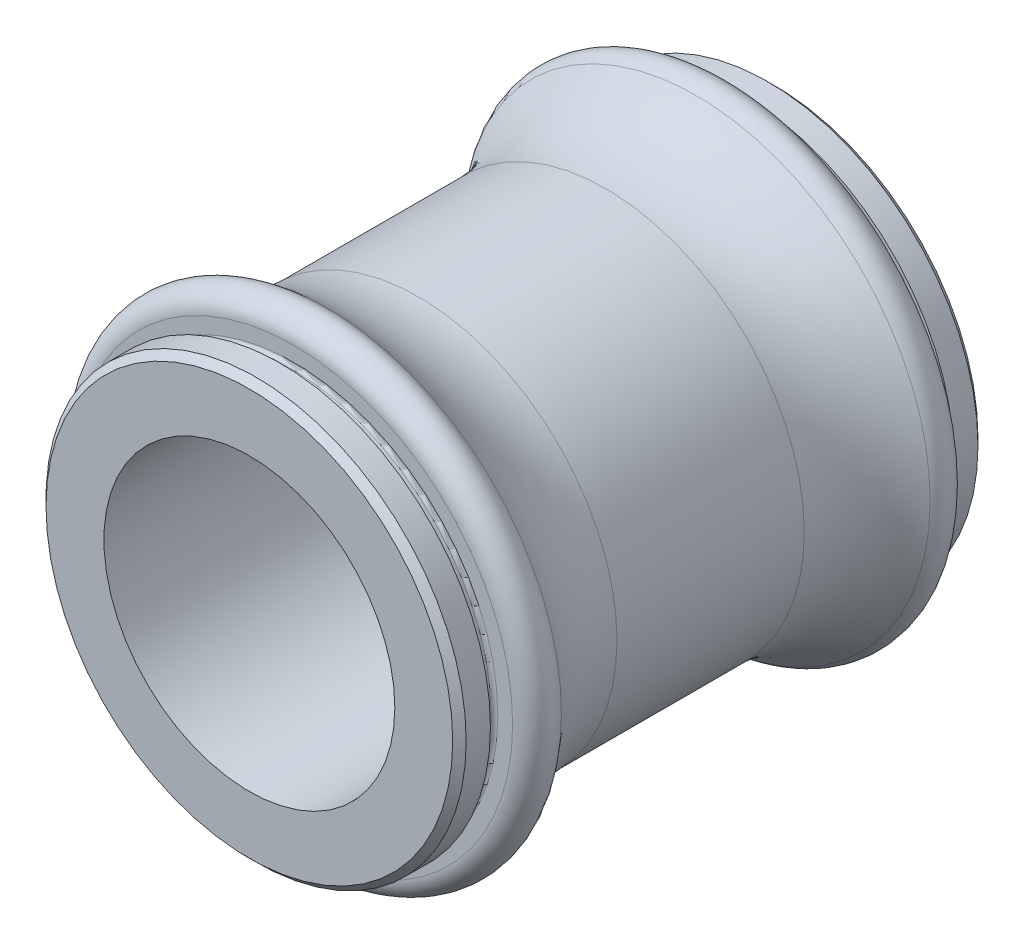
ISO-10303-21;
HEADER;
FILE_DESCRIPTION(('STEP AP214'),'2;1');
FILE_NAME('part.step','',(''),(''),'','','');
FILE_SCHEMA(('AUTOMOTIVE_DESIGN { 1 0 10303 214 1 1 1 1 }'));
ENDSEC;
DATA;
#1=APPLICATION_CONTEXT('core data for automotive mechanical design processes');
#2=APPLICATION_PROTOCOL_DEFINITION('international standard','automotive_design',2000,#1);
#3=PRODUCT_CONTEXT('',#1,'mechanical');
#4=PRODUCT('Part','Part','',(#3));
#5=PRODUCT_RELATED_PRODUCT_CATEGORY('part','',(#4));
#6=PRODUCT_DEFINITION_FORMATION('','',#4);
#7=PRODUCT_DEFINITION_CONTEXT('part definition',#1,'design');
#8=PRODUCT_DEFINITION('design','',#6,#7);
#9=PRODUCT_DEFINITION_SHAPE('','',#8);
#10=(LENGTH_UNIT() NAMED_UNIT(*) SI_UNIT(.MILLI.,.METRE.));
#11=(NAMED_UNIT(*) PLANE_ANGLE_UNIT() SI_UNIT($,.RADIAN.));
#12=(NAMED_UNIT(*) SI_UNIT($,.STERADIAN.) SOLID_ANGLE_UNIT());
#13=UNCERTAINTY_MEASURE_WITH_UNIT(LENGTH_MEASURE(1.E-05),#10,'distance_accuracy_value','');
#14=(GEOMETRIC_REPRESENTATION_CONTEXT(3) GLOBAL_UNCERTAINTY_ASSIGNED_CONTEXT((#13)) GLOBAL_UNIT_ASSIGNED_CONTEXT((#10,
#11,#12)) REPRESENTATION_CONTEXT('',''));
#15=CARTESIAN_POINT('',(0.,0.,0.));
#16=DIRECTION('',(0.,0.,1.));
#17=DIRECTION('',(1.,0.,0.));
#18=AXIS2_PLACEMENT_3D('',#15,#16,#17);
#19=CARTESIAN_POINT('',(0.,15.1,39.));
#20=DIRECTION('',(0.,0.,-1.));
#21=DIRECTION('',(-1.,0.,0.));
#22=AXIS2_PLACEMENT_3D('',#19,#20,#21);
#23=PLANE('',#22);
#24=CARTESIAN_POINT('',(0.,0.,39.));
#25=DIRECTION('',(0.,0.,1.));
#26=DIRECTION('',(1.,0.,0.));
#27=AXIS2_PLACEMENT_3D('',#24,#25,#26);
#28=CIRCLE('',#27,10.8);
#29=CARTESIAN_POINT('',(10.8,0.,39.));
#30=VERTEX_POINT('',#29);
#31=EDGE_CURVE('E103',#30,#30,#28,.T.);
#32=ORIENTED_EDGE('',*,*,#31,.F.);
#33=EDGE_LOOP('',(#32));
#34=FACE_BOUND('',#33,.T.);
#35=CARTESIAN_POINT('',(0.,0.,39.));
#36=DIRECTION('',(0.,0.,1.));
#37=DIRECTION('',(1.,0.,0.));
#38=AXIS2_PLACEMENT_3D('',#35,#36,#37);
#39=CIRCLE('',#38,15.1);
#40=CARTESIAN_POINT('',(15.1,0.,39.));
#41=VERTEX_POINT('',#40);
#42=EDGE_CURVE('E10',#41,#41,#39,.T.);
#43=ORIENTED_EDGE('',*,*,#42,.T.);
#44=EDGE_LOOP('',(#43));
#45=FACE_BOUND('',#44,.T.);
#46=ADVANCED_FACE('F33',(#34,#45),#23,.F.);
#47=CARTESIAN_POINT('',(0.,0.,38.5));
#48=DIRECTION('',(0.,0.,-1.));
#49=DIRECTION('',(-1.,0.,0.));
#50=AXIS2_PLACEMENT_3D('',#47,#48,#49);
#51=CONICAL_SURFACE('',#50,15.6,0.785398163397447);
#52=ORIENTED_EDGE('',*,*,#42,.F.);
#53=EDGE_LOOP('',(#52));
#54=FACE_BOUND('',#53,.T.);
#55=CARTESIAN_POINT('',(0.,0.,38.5));
#56=DIRECTION('',(0.,0.,1.));
#57=DIRECTION('',(1.,0.,0.));
#58=AXIS2_PLACEMENT_3D('',#55,#56,#57);
#59=CIRCLE('',#58,15.6);
#60=CARTESIAN_POINT('',(15.6,0.,38.5));
#61=VERTEX_POINT('',#60);
#62=EDGE_CURVE('E39',#61,#61,#59,.T.);
#63=ORIENTED_EDGE('',*,*,#62,.T.);
#64=EDGE_LOOP('',(#63));
#65=FACE_BOUND('',#64,.T.);
#66=ADVANCED_FACE('F110',(#54,#65),#51,.T.);
#67=CARTESIAN_POINT('',(0.,0.,0.));
#68=DIRECTION('',(0.,0.,1.));
#69=DIRECTION('',(1.,0.,0.));
#70=AXIS2_PLACEMENT_3D('',#67,#68,#69);
#71=CYLINDRICAL_SURFACE('',#70,15.6);
#72=ORIENTED_EDGE('',*,*,#62,.F.);
#73=EDGE_LOOP('',(#72));
#74=FACE_BOUND('',#73,.T.);
#75=CARTESIAN_POINT('',(0.,0.,36.7));
#76=DIRECTION('',(0.,0.,1.));
#77=DIRECTION('',(1.,0.,0.));
#78=AXIS2_PLACEMENT_3D('',#75,#76,#77);
#79=CIRCLE('',#78,15.6);
#80=CARTESIAN_POINT('',(15.6,0.,36.7));
#81=VERTEX_POINT('',#80);
#82=EDGE_CURVE('E43',#81,#81,#79,.T.);
#83=ORIENTED_EDGE('',*,*,#82,.T.);
#84=EDGE_LOOP('',(#83));
#85=FACE_BOUND('',#84,.T.);
#86=ADVANCED_FACE('F114',(#74,#85),#71,.T.);
#87=CARTESIAN_POINT('',(0.,15.15,36.7));
#88=DIRECTION('',(0.,0.,1.));
#89=DIRECTION('',(1.,0.,0.));
#90=AXIS2_PLACEMENT_3D('',#87,#88,#89);
#91=PLANE('',#90);
#92=ORIENTED_EDGE('',*,*,#82,.F.);
#93=EDGE_LOOP('',(#92));
#94=FACE_BOUND('',#93,.T.);
#95=CARTESIAN_POINT('',(0.,0.,36.7));
#96=DIRECTION('',(0.,0.,1.));
#97=DIRECTION('',(1.,0.,0.));
#98=AXIS2_PLACEMENT_3D('',#95,#96,#97);
#99=CIRCLE('',#98,15.15);
#100=CARTESIAN_POINT('',(15.15,0.,36.7));
#101=VERTEX_POINT('',#100);
#102=EDGE_CURVE('E47',#101,#101,#99,.T.);
#103=ORIENTED_EDGE('',*,*,#102,.T.);
#104=EDGE_LOOP('',(#103));
#105=FACE_BOUND('',#104,.T.);
#106=ADVANCED_FACE('F119',(#94,#105),#91,.F.);
#107=CARTESIAN_POINT('',(0.,0.,36.45));
#108=DIRECTION('',(0.,0.,1.));
#109=DIRECTION('',(1.,0.,0.));
#110=AXIS2_PLACEMENT_3D('',#107,#108,#109);
#111=TOROIDAL_SURFACE('',#110,15.15,0.250000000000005);
#112=ORIENTED_EDGE('',*,*,#102,.F.);
#113=EDGE_LOOP('',(#112));
#114=FACE_BOUND('',#113,.T.);
#115=CARTESIAN_POINT('',(0.,0.,36.45));
#116=DIRECTION('',(0.,0.,1.));
#117=DIRECTION('',(1.,0.,0.));
#118=AXIS2_PLACEMENT_3D('',#115,#116,#117);
#119=CIRCLE('',#118,14.9);
#120=CARTESIAN_POINT('',(14.9,0.,36.45));
#121=VERTEX_POINT('',#120);
#122=EDGE_CURVE('E52',#121,#121,#119,.T.);
#123=ORIENTED_EDGE('',*,*,#122,.T.);
#124=EDGE_LOOP('',(#123));
#125=FACE_BOUND('',#124,.T.);
#126=ADVANCED_FACE('F125',(#114,#125),#111,.F.);
#127=CARTESIAN_POINT('',(0.,0.,0.));
#128=DIRECTION('',(0.,0.,1.));
#129=DIRECTION('',(1.,0.,0.));
#130=AXIS2_PLACEMENT_3D('',#127,#128,#129);
#131=CYLINDRICAL_SURFACE('',#130,14.9);
#132=ORIENTED_EDGE('',*,*,#122,.F.);
#133=EDGE_LOOP('',(#132));
#134=FACE_BOUND('',#133,.T.);
#135=CARTESIAN_POINT('',(0.,0.,35.95));
#136=DIRECTION('',(0.,0.,1.));
#137=DIRECTION('',(1.,0.,0.));
#138=AXIS2_PLACEMENT_3D('',#135,#136,#137);
#139=CIRCLE('',#138,14.9);
#140=CARTESIAN_POINT('',(14.9,0.,35.95));
#141=VERTEX_POINT('',#140);
#142=EDGE_CURVE('E55',#141,#141,#139,.T.);
#143=ORIENTED_EDGE('',*,*,#142,.T.);
#144=EDGE_LOOP('',(#143));
#145=FACE_BOUND('',#144,.T.);
#146=ADVANCED_FACE('F129',(#134,#145),#131,.T.);
#147=CARTESIAN_POINT('',(0.,0.,35.95));
#148=DIRECTION('',(0.,0.,1.));
#149=DIRECTION('',(1.,0.,0.));
#150=AXIS2_PLACEMENT_3D('',#147,#148,#149);
#151=TOROIDAL_SURFACE('',#150,15.15,0.250000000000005);
#152=ORIENTED_EDGE('',*,*,#142,.F.);
#153=EDGE_LOOP('',(#152));
#154=FACE_BOUND('',#153,.T.);
#155=CARTESIAN_POINT('',(0.,0.,35.7));
#156=DIRECTION('',(0.,0.,1.));
#157=DIRECTION('',(1.,0.,0.));
#158=AXIS2_PLACEMENT_3D('',#155,#156,#157);
#159=CIRCLE('',#158,15.15);
#160=CARTESIAN_POINT('',(15.15,0.,35.7));
#161=VERTEX_POINT('',#160);
#162=EDGE_CURVE('E58',#161,#161,#159,.T.);
#163=ORIENTED_EDGE('',*,*,#162,.T.);
#164=EDGE_LOOP('',(#163));
#165=FACE_BOUND('',#164,.T.);
#166=ADVANCED_FACE('F133',(#154,#165),#151,.F.);
#167=CARTESIAN_POINT('',(0.,16.25,35.7));
#168=DIRECTION('',(0.,0.,-1.));
#169=DIRECTION('',(-1.,0.,0.));
#170=AXIS2_PLACEMENT_3D('',#167,#168,#169);
#171=PLANE('',#170);
#172=ORIENTED_EDGE('',*,*,#162,.F.);
#173=EDGE_LOOP('',(#172));
#174=FACE_BOUND('',#173,.T.);
#175=CARTESIAN_POINT('',(0.,0.,35.7));
#176=DIRECTION('',(0.,0.,1.));
#177=DIRECTION('',(1.,0.,0.));
#178=AXIS2_PLACEMENT_3D('',#175,#176,#177);
#179=CIRCLE('',#178,16.25);
#180=CARTESIAN_POINT('',(16.25,0.,35.7));
#181=VERTEX_POINT('',#180);
#182=EDGE_CURVE('E61',#181,#181,#179,.T.);
#183=ORIENTED_EDGE('',*,*,#182,.T.);
#184=EDGE_LOOP('',(#183));
#185=FACE_BOUND('',#184,.T.);
#186=ADVANCED_FACE('F137',(#174,#185),#171,.F.);
#187=CARTESIAN_POINT('',(0.,0.,34.2));
#188=DIRECTION('',(0.,0.,1.));
#189=DIRECTION('',(1.,0.,0.));
#190=AXIS2_PLACEMENT_3D('',#187,#188,#189);
#191=TOROIDAL_SURFACE('',#190,16.25,1.5);
#192=ORIENTED_EDGE('',*,*,#182,.F.);
#193=EDGE_LOOP('',(#192));
#194=FACE_BOUND('',#193,.T.);
#195=CARTESIAN_POINT('',(0.,0.,33.1896565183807));
#196=DIRECTION('',(0.,0.,1.));
#197=DIRECTION('',(1.,0.,0.));
#198=AXIS2_PLACEMENT_3D('',#195,#196,#197);
#199=CIRCLE('',#198,17.3586956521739);
#200=CARTESIAN_POINT('',(17.3586956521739,0.,33.1896565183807));
#201=VERTEX_POINT('',#200);
#202=EDGE_CURVE('E64',#201,#201,#199,.T.);
#203=ORIENTED_EDGE('',*,*,#202,.T.);
#204=EDGE_LOOP('',(#203));
#205=FACE_BOUND('',#204,.T.);
#206=ADVANCED_FACE('F141',(#194,#205),#191,.T.);
#207=CARTESIAN_POINT('',(0.,0.,26.4540333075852));
#208=DIRECTION('',(0.,0.,1.));
#209=DIRECTION('',(1.,0.,0.));
#210=AXIS2_PLACEMENT_3D('',#207,#208,#209);
#211=TOROIDAL_SURFACE('',#210,24.75,10.);
#212=ORIENTED_EDGE('',*,*,#202,.F.);
#213=EDGE_LOOP('',(#212));
#214=FACE_BOUND('',#213,.T.);
#215=CARTESIAN_POINT('',(0.,0.,26.4540333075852));
#216=DIRECTION('',(0.,0.,1.));
#217=DIRECTION('',(1.,0.,0.));
#218=AXIS2_PLACEMENT_3D('',#215,#216,#217);
#219=CIRCLE('',#218,14.75);
#220=CARTESIAN_POINT('',(14.75,0.,26.4540333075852));
#221=VERTEX_POINT('',#220);
#222=EDGE_CURVE('E67',#221,#221,#219,.T.);
#223=ORIENTED_EDGE('',*,*,#222,.T.);
#224=EDGE_LOOP('',(#223));
#225=FACE_BOUND('',#224,.T.);
#226=ADVANCED_FACE('F145',(#214,#225),#211,.F.);
#227=CARTESIAN_POINT('',(0.,0.,0.));
#228=DIRECTION('',(0.,0.,1.));
#229=DIRECTION('',(1.,0.,0.));
#230=AXIS2_PLACEMENT_3D('',#227,#228,#229);
#231=CYLINDRICAL_SURFACE('',#230,14.75);
#232=ORIENTED_EDGE('',*,*,#222,.F.);
#233=EDGE_LOOP('',(#232));
#234=FACE_BOUND('',#233,.T.);
#235=CARTESIAN_POINT('',(0.,0.,12.5459666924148));
#236=DIRECTION('',(0.,0.,1.));
#237=DIRECTION('',(1.,0.,0.));
#238=AXIS2_PLACEMENT_3D('',#235,#236,#237);
#239=CIRCLE('',#238,14.75);
#240=CARTESIAN_POINT('',(14.75,0.,12.5459666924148));
#241=VERTEX_POINT('',#240);
#242=EDGE_CURVE('E70',#241,#241,#239,.T.);
#243=ORIENTED_EDGE('',*,*,#242,.T.);
#244=EDGE_LOOP('',(#243));
#245=FACE_BOUND('',#244,.T.);
#246=ADVANCED_FACE('F149',(#234,#245),#231,.T.);
#247=CARTESIAN_POINT('',(0.,0.,12.5459666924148));
#248=DIRECTION('',(0.,0.,1.));
#249=DIRECTION('',(1.,0.,0.));
#250=AXIS2_PLACEMENT_3D('',#247,#248,#249);
#251=TOROIDAL_SURFACE('',#250,24.75,10.);
#252=ORIENTED_EDGE('',*,*,#242,.F.);
#253=EDGE_LOOP('',(#252));
#254=FACE_BOUND('',#253,.T.);
#255=CARTESIAN_POINT('',(0.,0.,5.81034348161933));
#256=DIRECTION('',(0.,0.,1.));
#257=DIRECTION('',(1.,0.,0.));
#258=AXIS2_PLACEMENT_3D('',#255,#256,#257);
#259=CIRCLE('',#258,17.3586956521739);
#260=CARTESIAN_POINT('',(17.3586956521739,0.,5.81034348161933));
#261=VERTEX_POINT('',#260);
#262=EDGE_CURVE('E73',#261,#261,#259,.T.);
#263=ORIENTED_EDGE('',*,*,#262,.T.);
#264=EDGE_LOOP('',(#263));
#265=FACE_BOUND('',#264,.T.);
#266=ADVANCED_FACE('F153',(#254,#265),#251,.F.);
#267=CARTESIAN_POINT('',(0.,0.,4.8));
#268=DIRECTION('',(0.,0.,1.));
#269=DIRECTION('',(1.,0.,0.));
#270=AXIS2_PLACEMENT_3D('',#267,#268,#269);
#271=TOROIDAL_SURFACE('',#270,16.25,1.5);
#272=ORIENTED_EDGE('',*,*,#262,.F.);
#273=EDGE_LOOP('',(#272));
#274=FACE_BOUND('',#273,.T.);
#275=CARTESIAN_POINT('',(0.,0.,3.3));
#276=DIRECTION('',(0.,0.,1.));
#277=DIRECTION('',(1.,0.,0.));
#278=AXIS2_PLACEMENT_3D('',#275,#276,#277);
#279=CIRCLE('',#278,16.25);
#280=CARTESIAN_POINT('',(16.25,0.,3.3));
#281=VERTEX_POINT('',#280);
#282=EDGE_CURVE('E76',#281,#281,#279,.T.);
#283=ORIENTED_EDGE('',*,*,#282,.T.);
#284=EDGE_LOOP('',(#283));
#285=FACE_BOUND('',#284,.T.);
#286=ADVANCED_FACE('F157',(#274,#285),#271,.T.);
#287=CARTESIAN_POINT('',(0.,15.15,3.3));
#288=DIRECTION('',(0.,0.,1.));
#289=DIRECTION('',(1.,0.,0.));
#290=AXIS2_PLACEMENT_3D('',#287,#288,#289);
#291=PLANE('',#290);
#292=ORIENTED_EDGE('',*,*,#282,.F.);
#293=EDGE_LOOP('',(#292));
#294=FACE_BOUND('',#293,.T.);
#295=CARTESIAN_POINT('',(0.,0.,3.3));
#296=DIRECTION('',(0.,0.,1.));
#297=DIRECTION('',(1.,0.,0.));
#298=AXIS2_PLACEMENT_3D('',#295,#296,#297);
#299=CIRCLE('',#298,15.15);
#300=CARTESIAN_POINT('',(15.15,0.,3.3));
#301=VERTEX_POINT('',#300);
#302=EDGE_CURVE('E79',#301,#301,#299,.T.);
#303=ORIENTED_EDGE('',*,*,#302,.T.);
#304=EDGE_LOOP('',(#303));
#305=FACE_BOUND('',#304,.T.);
#306=ADVANCED_FACE('F161',(#294,#305),#291,.F.);
#307=CARTESIAN_POINT('',(0.,0.,3.05));
#308=DIRECTION('',(0.,0.,1.));
#309=DIRECTION('',(1.,0.,0.));
#310=AXIS2_PLACEMENT_3D('',#307,#308,#309);
#311=TOROIDAL_SURFACE('',#310,15.15,0.250000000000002);
#312=ORIENTED_EDGE('',*,*,#302,.F.);
#313=EDGE_LOOP('',(#312));
#314=FACE_BOUND('',#313,.T.);
#315=CARTESIAN_POINT('',(0.,0.,3.05));
#316=DIRECTION('',(0.,0.,1.));
#317=DIRECTION('',(1.,0.,0.));
#318=AXIS2_PLACEMENT_3D('',#315,#316,#317);
#319=CIRCLE('',#318,14.9);
#320=CARTESIAN_POINT('',(14.9,0.,3.05));
#321=VERTEX_POINT('',#320);
#322=EDGE_CURVE('E82',#321,#321,#319,.T.);
#323=ORIENTED_EDGE('',*,*,#322,.T.);
#324=EDGE_LOOP('',(#323));
#325=FACE_BOUND('',#324,.T.);
#326=ADVANCED_FACE('F165',(#314,#325),#311,.F.);
#327=CARTESIAN_POINT('',(0.,0.,0.));
#328=DIRECTION('',(0.,0.,1.));
#329=DIRECTION('',(1.,0.,0.));
#330=AXIS2_PLACEMENT_3D('',#327,#328,#329);
#331=CYLINDRICAL_SURFACE('',#330,14.9);
#332=ORIENTED_EDGE('',*,*,#322,.F.);
#333=EDGE_LOOP('',(#332));
#334=FACE_BOUND('',#333,.T.);
#335=CARTESIAN_POINT('',(0.,0.,2.55));
#336=DIRECTION('',(0.,0.,1.));
#337=DIRECTION('',(1.,0.,0.));
#338=AXIS2_PLACEMENT_3D('',#335,#336,#337);
#339=CIRCLE('',#338,14.9);
#340=CARTESIAN_POINT('',(14.9,0.,2.55));
#341=VERTEX_POINT('',#340);
#342=EDGE_CURVE('E85',#341,#341,#339,.T.);
#343=ORIENTED_EDGE('',*,*,#342,.T.);
#344=EDGE_LOOP('',(#343));
#345=FACE_BOUND('',#344,.T.);
#346=ADVANCED_FACE('F169',(#334,#345),#331,.T.);
#347=CARTESIAN_POINT('',(0.,0.,2.55));
#348=DIRECTION('',(0.,0.,1.));
#349=DIRECTION('',(1.,0.,0.));
#350=AXIS2_PLACEMENT_3D('',#347,#348,#349);
#351=TOROIDAL_SURFACE('',#350,15.15,0.250000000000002);
#352=ORIENTED_EDGE('',*,*,#342,.F.);
#353=EDGE_LOOP('',(#352));
#354=FACE_BOUND('',#353,.T.);
#355=CARTESIAN_POINT('',(0.,0.,2.3));
#356=DIRECTION('',(0.,0.,1.));
#357=DIRECTION('',(1.,0.,0.));
#358=AXIS2_PLACEMENT_3D('',#355,#356,#357);
#359=CIRCLE('',#358,15.15);
#360=CARTESIAN_POINT('',(15.15,0.,2.3));
#361=VERTEX_POINT('',#360);
#362=EDGE_CURVE('E88',#361,#361,#359,.T.);
#363=ORIENTED_EDGE('',*,*,#362,.T.);
#364=EDGE_LOOP('',(#363));
#365=FACE_BOUND('',#364,.T.);
#366=ADVANCED_FACE('F173',(#354,#365),#351,.F.);
#367=CARTESIAN_POINT('',(0.,15.6,2.3));
#368=DIRECTION('',(0.,0.,-1.));
#369=DIRECTION('',(-1.,0.,0.));
#370=AXIS2_PLACEMENT_3D('',#367,#368,#369);
#371=PLANE('',#370);
#372=ORIENTED_EDGE('',*,*,#362,.F.);
#373=EDGE_LOOP('',(#372));
#374=FACE_BOUND('',#373,.T.);
#375=CARTESIAN_POINT('',(0.,0.,2.3));
#376=DIRECTION('',(0.,0.,1.));
#377=DIRECTION('',(1.,0.,0.));
#378=AXIS2_PLACEMENT_3D('',#375,#376,#377);
#379=CIRCLE('',#378,15.6);
#380=CARTESIAN_POINT('',(15.6,0.,2.3));
#381=VERTEX_POINT('',#380);
#382=EDGE_CURVE('E91',#381,#381,#379,.T.);
#383=ORIENTED_EDGE('',*,*,#382,.T.);
#384=EDGE_LOOP('',(#383));
#385=FACE_BOUND('',#384,.T.);
#386=ADVANCED_FACE('F177',(#374,#385),#371,.F.);
#387=CARTESIAN_POINT('',(0.,0.,0.));
#388=DIRECTION('',(0.,0.,1.));
#389=DIRECTION('',(1.,0.,0.));
#390=AXIS2_PLACEMENT_3D('',#387,#388,#389);
#391=CYLINDRICAL_SURFACE('',#390,15.6);
#392=ORIENTED_EDGE('',*,*,#382,.F.);
#393=EDGE_LOOP('',(#392));
#394=FACE_BOUND('',#393,.T.);
#395=CARTESIAN_POINT('',(0.,0.,0.5));
#396=DIRECTION('',(0.,0.,1.));
#397=DIRECTION('',(1.,0.,0.));
#398=AXIS2_PLACEMENT_3D('',#395,#396,#397);
#399=CIRCLE('',#398,15.6);
#400=CARTESIAN_POINT('',(15.6,0.,0.5));
#401=VERTEX_POINT('',#400);
#402=EDGE_CURVE('E94',#401,#401,#399,.T.);
#403=ORIENTED_EDGE('',*,*,#402,.T.);
#404=EDGE_LOOP('',(#403));
#405=FACE_BOUND('',#404,.T.);
#406=ADVANCED_FACE('F181',(#394,#405),#391,.T.);
#407=CARTESIAN_POINT('',(0.,0.,0.));
#408=DIRECTION('',(0.,0.,1.));
#409=DIRECTION('',(1.,0.,0.));
#410=AXIS2_PLACEMENT_3D('',#407,#408,#409);
#411=CONICAL_SURFACE('',#410,15.1,0.785398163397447);
#412=ORIENTED_EDGE('',*,*,#402,.F.);
#413=EDGE_LOOP('',(#412));
#414=FACE_BOUND('',#413,.T.);
#415=CARTESIAN_POINT('',(0.,0.,0.));
#416=DIRECTION('',(0.,0.,1.));
#417=DIRECTION('',(1.,0.,0.));
#418=AXIS2_PLACEMENT_3D('',#415,#416,#417);
#419=CIRCLE('',#418,15.1);
#420=CARTESIAN_POINT('',(15.1,0.,0.));
#421=VERTEX_POINT('',#420);
#422=EDGE_CURVE('E97',#421,#421,#419,.T.);
#423=ORIENTED_EDGE('',*,*,#422,.T.);
#424=EDGE_LOOP('',(#423));
#425=FACE_BOUND('',#424,.T.);
#426=ADVANCED_FACE('F185',(#414,#425),#411,.T.);
#427=CARTESIAN_POINT('',(0.,10.8,0.));
#428=DIRECTION('',(0.,0.,1.));
#429=DIRECTION('',(1.,0.,0.));
#430=AXIS2_PLACEMENT_3D('',#427,#428,#429);
#431=PLANE('',#430);
#432=ORIENTED_EDGE('',*,*,#422,.F.);
#433=EDGE_LOOP('',(#432));
#434=FACE_BOUND('',#433,.T.);
#435=CARTESIAN_POINT('',(0.,0.,0.));
#436=DIRECTION('',(0.,0.,1.));
#437=DIRECTION('',(1.,0.,0.));
#438=AXIS2_PLACEMENT_3D('',#435,#436,#437);
#439=CIRCLE('',#438,10.8);
#440=CARTESIAN_POINT('',(10.8,0.,0.));
#441=VERTEX_POINT('',#440);
#442=EDGE_CURVE('E100',#441,#441,#439,.T.);
#443=ORIENTED_EDGE('',*,*,#442,.T.);
#444=EDGE_LOOP('',(#443));
#445=FACE_BOUND('',#444,.T.);
#446=ADVANCED_FACE('F189',(#434,#445),#431,.F.);
#447=CARTESIAN_POINT('',(0.,0.,0.));
#448=DIRECTION('',(0.,0.,1.));
#449=DIRECTION('',(1.,0.,0.));
#450=AXIS2_PLACEMENT_3D('',#447,#448,#449);
#451=CYLINDRICAL_SURFACE('',#450,10.8);
#452=ORIENTED_EDGE('',*,*,#442,.F.);
#453=EDGE_LOOP('',(#452));
#454=FACE_BOUND('',#453,.T.);
#455=ORIENTED_EDGE('',*,*,#31,.T.);
#456=EDGE_LOOP('',(#455));
#457=FACE_BOUND('',#456,.T.);
#458=ADVANCED_FACE('F107',(#454,#457),#451,.F.);
#459=CLOSED_SHELL('',(#46,#66,#86,#106,#126,#146,#166,#186,#206,#226,#246,#266,#286,#306,#326,
#346,#366,#386,#406,#426,#446,#458));
#460=MANIFOLD_SOLID_BREP('B2',#459);
#461=ADVANCED_BREP_SHAPE_REPRESENTATION('',(#18,#460),#14);
#462=SHAPE_DEFINITION_REPRESENTATION(#9,#461);
ENDSEC;
END-ISO-10303-21;
